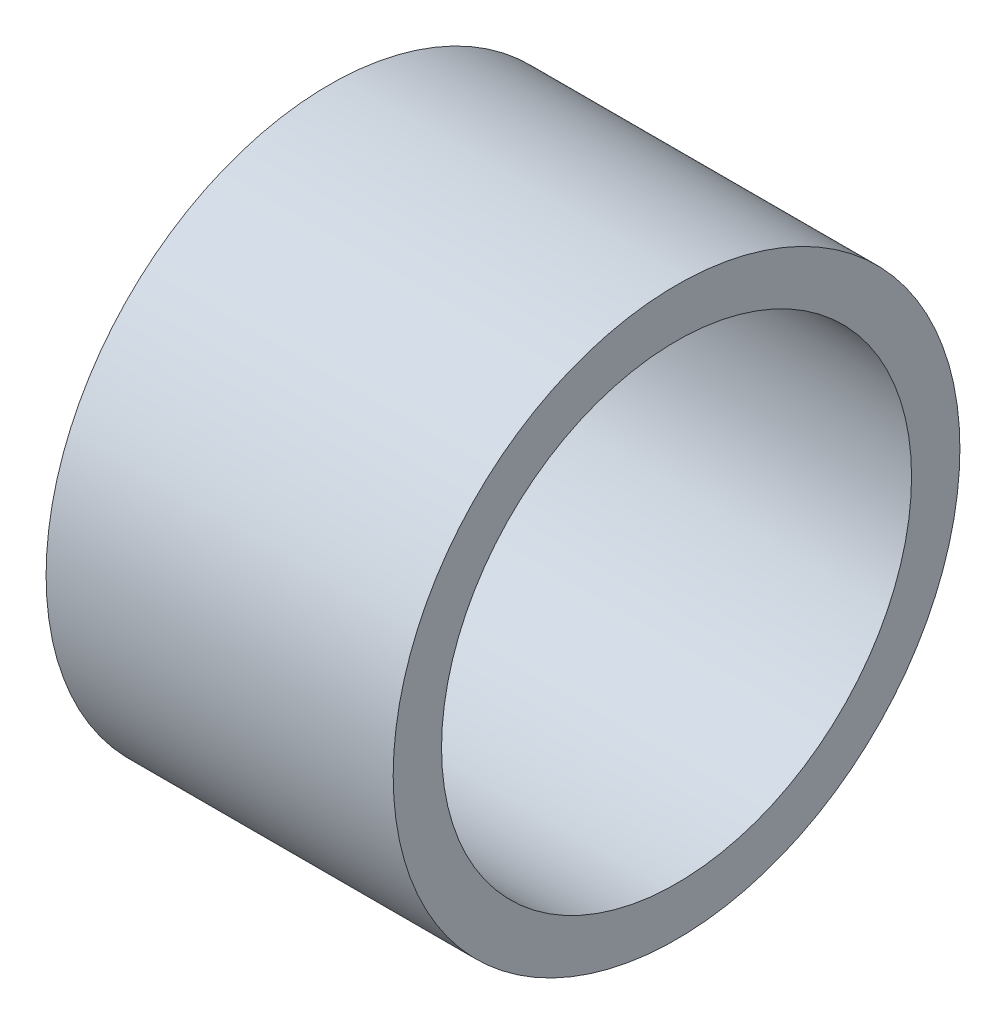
ISO-10303-21;
HEADER;
FILE_DESCRIPTION(('STEP AP214'),'2;1');
FILE_NAME('part.step','',(''),(''),'','','');
FILE_SCHEMA(('AUTOMOTIVE_DESIGN { 1 0 10303 214 1 1 1 1 }'));
ENDSEC;
DATA;
#1=APPLICATION_CONTEXT('core data for automotive mechanical design processes');
#2=APPLICATION_PROTOCOL_DEFINITION('international standard','automotive_design',2000,#1);
#3=PRODUCT_CONTEXT('',#1,'mechanical');
#4=PRODUCT('Part','Part','',(#3));
#5=PRODUCT_RELATED_PRODUCT_CATEGORY('part','',(#4));
#6=PRODUCT_DEFINITION_FORMATION('','',#4);
#7=PRODUCT_DEFINITION_CONTEXT('part definition',#1,'design');
#8=PRODUCT_DEFINITION('design','',#6,#7);
#9=PRODUCT_DEFINITION_SHAPE('','',#8);
#10=(LENGTH_UNIT() NAMED_UNIT(*) SI_UNIT(.MILLI.,.METRE.));
#11=(NAMED_UNIT(*) PLANE_ANGLE_UNIT() SI_UNIT($,.RADIAN.));
#12=(NAMED_UNIT(*) SI_UNIT($,.STERADIAN.) SOLID_ANGLE_UNIT());
#13=UNCERTAINTY_MEASURE_WITH_UNIT(LENGTH_MEASURE(1.E-05),#10,'distance_accuracy_value','');
#14=(GEOMETRIC_REPRESENTATION_CONTEXT(3) GLOBAL_UNCERTAINTY_ASSIGNED_CONTEXT((#13)) GLOBAL_UNIT_ASSIGNED_CONTEXT((#10,
#11,#12)) REPRESENTATION_CONTEXT('',''));
#15=CARTESIAN_POINT('',(0.,0.,0.));
#16=DIRECTION('',(0.,0.,1.));
#17=DIRECTION('',(1.,0.,0.));
#18=AXIS2_PLACEMENT_3D('',#15,#16,#17);
#19=CARTESIAN_POINT('',(106.977861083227,-154.573977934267,0.));
#20=DIRECTION('',(-1.,0.,0.));
#21=DIRECTION('',(0.,0.,1.));
#22=AXIS2_PLACEMENT_3D('',#19,#20,#21);
#23=PLANE('',#22);
#24=CARTESIAN_POINT('',(106.977861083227,-170.823977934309,0.));
#25=DIRECTION('',(-1.,0.,0.));
#26=DIRECTION('',(0.,0.,1.));
#27=AXIS2_PLACEMENT_3D('',#24,#25,#26);
#28=CIRCLE('',#27,19.5935648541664);
#29=CARTESIAN_POINT('',(106.977861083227,-170.823977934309,19.5935648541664));
#30=VERTEX_POINT('',#29);
#31=EDGE_CURVE('E10',#30,#30,#28,.T.);
#32=ORIENTED_EDGE('',*,*,#31,.F.);
#33=EDGE_LOOP('',(#32));
#34=FACE_BOUND('',#33,.T.);
#35=CARTESIAN_POINT('',(106.977861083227,-170.823977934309,0.));
#36=DIRECTION('',(-1.,0.,0.));
#37=DIRECTION('',(0.,0.,1.));
#38=AXIS2_PLACEMENT_3D('',#35,#36,#37);
#39=CIRCLE('',#38,16.2500000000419);
#40=CARTESIAN_POINT('',(106.977861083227,-170.823977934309,16.2500000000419));
#41=VERTEX_POINT('',#40);
#42=EDGE_CURVE('E45',#41,#41,#39,.T.);
#43=ORIENTED_EDGE('',*,*,#42,.T.);
#44=EDGE_LOOP('',(#43));
#45=FACE_BOUND('',#44,.T.);
#46=ADVANCED_FACE('F31',(#34,#45),#23,.F.);
#47=CARTESIAN_POINT('',(54.6897351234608,-170.823977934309,0.));
#48=DIRECTION('',(-1.,0.,0.));
#49=DIRECTION('',(0.,0.,1.));
#50=AXIS2_PLACEMENT_3D('',#47,#48,#49);
#51=CYLINDRICAL_SURFACE('',#50,19.5935648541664);
#52=CARTESIAN_POINT('',(82.9778610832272,-170.823977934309,0.));
#53=DIRECTION('',(-1.,0.,0.));
#54=DIRECTION('',(0.,0.,1.));
#55=AXIS2_PLACEMENT_3D('',#52,#53,#54);
#56=CIRCLE('',#55,19.5935648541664);
#57=CARTESIAN_POINT('',(82.9778610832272,-170.823977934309,19.5935648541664));
#58=VERTEX_POINT('',#57);
#59=EDGE_CURVE('E37',#58,#58,#56,.T.);
#60=ORIENTED_EDGE('',*,*,#59,.F.);
#61=EDGE_LOOP('',(#60));
#62=FACE_BOUND('',#61,.T.);
#63=ORIENTED_EDGE('',*,*,#31,.T.);
#64=EDGE_LOOP('',(#63));
#65=FACE_BOUND('',#64,.T.);
#66=ADVANCED_FACE('F60',(#62,#65),#51,.T.);
#67=CARTESIAN_POINT('',(82.9778610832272,-154.573977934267,0.));
#68=DIRECTION('',(1.,0.,0.));
#69=DIRECTION('',(0.,0.,-1.));
#70=AXIS2_PLACEMENT_3D('',#67,#68,#69);
#71=PLANE('',#70);
#72=CARTESIAN_POINT('',(82.9778610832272,-170.823977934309,0.));
#73=DIRECTION('',(-1.,0.,0.));
#74=DIRECTION('',(0.,0.,1.));
#75=AXIS2_PLACEMENT_3D('',#72,#73,#74);
#76=CIRCLE('',#75,16.2500000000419);
#77=CARTESIAN_POINT('',(82.9778610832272,-170.823977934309,16.2500000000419));
#78=VERTEX_POINT('',#77);
#79=EDGE_CURVE('E41',#78,#78,#76,.T.);
#80=ORIENTED_EDGE('',*,*,#79,.F.);
#81=EDGE_LOOP('',(#80));
#82=FACE_BOUND('',#81,.T.);
#83=ORIENTED_EDGE('',*,*,#59,.T.);
#84=EDGE_LOOP('',(#83));
#85=FACE_BOUND('',#84,.T.);
#86=ADVANCED_FACE('F55',(#82,#85),#71,.F.);
#87=CARTESIAN_POINT('',(54.6897351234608,-170.823977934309,0.));
#88=DIRECTION('',(-1.,0.,0.));
#89=DIRECTION('',(0.,0.,1.));
#90=AXIS2_PLACEMENT_3D('',#87,#88,#89);
#91=CYLINDRICAL_SURFACE('',#90,16.2500000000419);
#92=ORIENTED_EDGE('',*,*,#42,.F.);
#93=EDGE_LOOP('',(#92));
#94=FACE_BOUND('',#93,.T.);
#95=ORIENTED_EDGE('',*,*,#79,.T.);
#96=EDGE_LOOP('',(#95));
#97=FACE_BOUND('',#96,.T.);
#98=ADVANCED_FACE('F52',(#94,#97),#91,.F.);
#99=CLOSED_SHELL('',(#46,#66,#86,#98));
#100=MANIFOLD_SOLID_BREP('B2',#99);
#101=ADVANCED_BREP_SHAPE_REPRESENTATION('',(#18,#100),#14);
#102=SHAPE_DEFINITION_REPRESENTATION(#9,#101);
ENDSEC;
END-ISO-10303-21;
